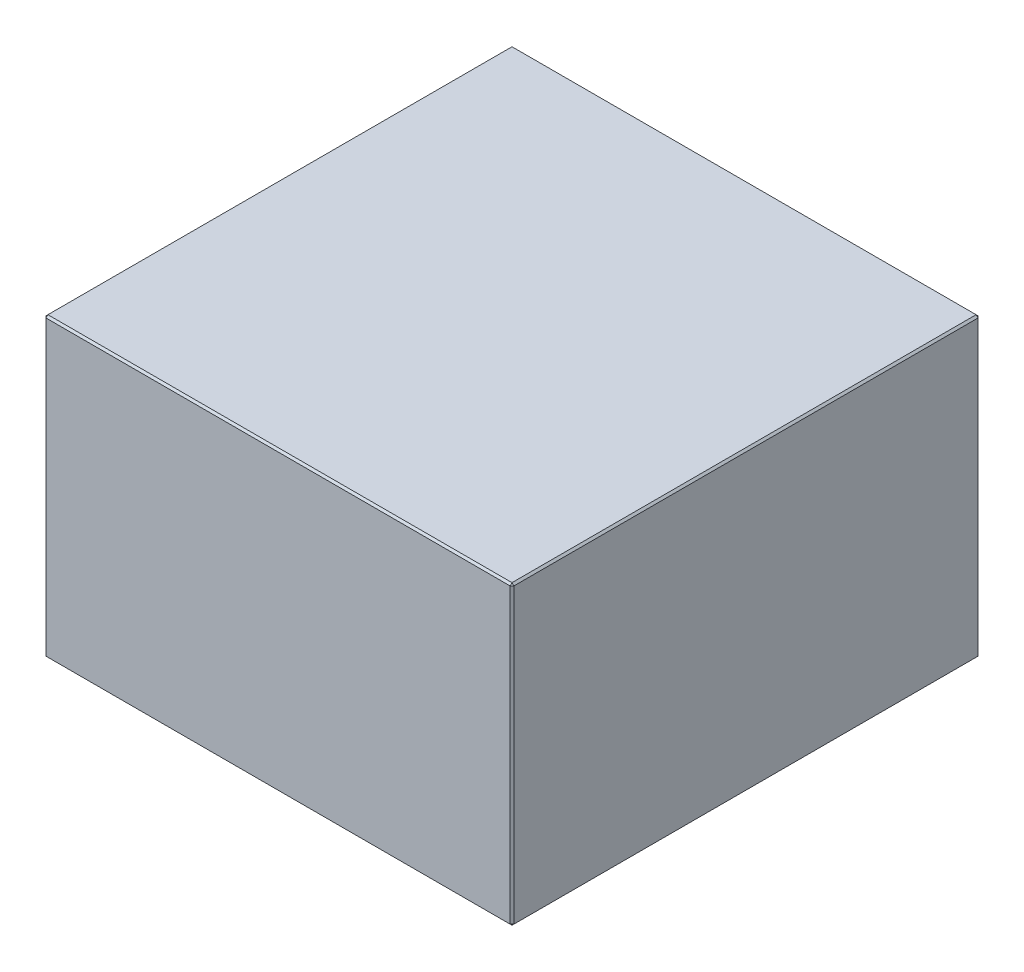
ISO-10303-21;
HEADER;
FILE_DESCRIPTION(('STEP AP214'),'2;1');
FILE_NAME('part.step','',(''),(''),'','','');
FILE_SCHEMA(('AUTOMOTIVE_DESIGN { 1 0 10303 214 1 1 1 1 }'));
ENDSEC;
DATA;
#1=APPLICATION_CONTEXT('core data for automotive mechanical design processes');
#2=APPLICATION_PROTOCOL_DEFINITION('international standard','automotive_design',2000,#1);
#3=PRODUCT_CONTEXT('',#1,'mechanical');
#4=PRODUCT('Part','Part','',(#3));
#5=PRODUCT_RELATED_PRODUCT_CATEGORY('part','',(#4));
#6=PRODUCT_DEFINITION_FORMATION('','',#4);
#7=PRODUCT_DEFINITION_CONTEXT('part definition',#1,'design');
#8=PRODUCT_DEFINITION('design','',#6,#7);
#9=PRODUCT_DEFINITION_SHAPE('','',#8);
#10=(LENGTH_UNIT() NAMED_UNIT(*) SI_UNIT(.MILLI.,.METRE.));
#11=(NAMED_UNIT(*) PLANE_ANGLE_UNIT() SI_UNIT($,.RADIAN.));
#12=(NAMED_UNIT(*) SI_UNIT($,.STERADIAN.) SOLID_ANGLE_UNIT());
#13=UNCERTAINTY_MEASURE_WITH_UNIT(LENGTH_MEASURE(1.E-05),#10,'distance_accuracy_value','');
#14=(GEOMETRIC_REPRESENTATION_CONTEXT(3) GLOBAL_UNCERTAINTY_ASSIGNED_CONTEXT((#13)) GLOBAL_UNIT_ASSIGNED_CONTEXT((#10,
#11,#12)) REPRESENTATION_CONTEXT('',''));
#15=CARTESIAN_POINT('',(0.,0.,0.));
#16=DIRECTION('',(0.,0.,1.));
#17=DIRECTION('',(1.,0.,0.));
#18=AXIS2_PLACEMENT_3D('',#15,#16,#17);
#19=CARTESIAN_POINT('',(-123.,156.,123.));
#20=DIRECTION('',(1.,0.,0.));
#21=DIRECTION('',(0.,0.,-1.));
#22=AXIS2_PLACEMENT_3D('',#19,#20,#21);
#23=PLANE('',#22);
#24=DIRECTION('',(0.,-1.,0.));
#25=VECTOR('',#24,1.);
#26=CARTESIAN_POINT('',(-123.,156.,-122.));
#27=LINE('',#26,#25);
#28=CARTESIAN_POINT('',(-123.,155.,-122.));
#29=VERTEX_POINT('',#28);
#30=CARTESIAN_POINT('',(-123.,0.999999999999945,-122.));
#31=VERTEX_POINT('',#30);
#32=EDGE_CURVE('E115',#29,#31,#27,.T.);
#33=ORIENTED_EDGE('',*,*,#32,.T.);
#34=DIRECTION('',(0.,0.,1.));
#35=VECTOR('',#34,1.);
#36=CARTESIAN_POINT('',(-123.,0.999999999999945,123.));
#37=LINE('',#36,#35);
#38=CARTESIAN_POINT('',(-123.,0.999999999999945,122.));
#39=VERTEX_POINT('',#38);
#40=EDGE_CURVE('E111',#31,#39,#37,.T.);
#41=ORIENTED_EDGE('',*,*,#40,.T.);
#42=DIRECTION('',(0.,1.,0.));
#43=VECTOR('',#42,1.);
#44=CARTESIAN_POINT('',(-123.,156.,122.));
#45=LINE('',#44,#43);
#46=CARTESIAN_POINT('',(-123.,155.,122.));
#47=VERTEX_POINT('',#46);
#48=EDGE_CURVE('E104',#39,#47,#45,.T.);
#49=ORIENTED_EDGE('',*,*,#48,.T.);
#50=DIRECTION('',(0.,0.,-1.));
#51=VECTOR('',#50,1.);
#52=CARTESIAN_POINT('',(-123.,155.,-123.));
#53=LINE('',#52,#51);
#54=EDGE_CURVE('E108',#47,#29,#53,.T.);
#55=ORIENTED_EDGE('',*,*,#54,.T.);
#56=EDGE_LOOP('',(#33,#41,#49,#55));
#57=FACE_BOUND('',#56,.T.);
#58=ADVANCED_FACE('F16',(#57),#23,.F.);
#59=CARTESIAN_POINT('',(123.,156.,123.));
#60=DIRECTION('',(0.,0.,-1.));
#61=DIRECTION('',(-1.,0.,0.));
#62=AXIS2_PLACEMENT_3D('',#59,#60,#61);
#63=PLANE('',#62);
#64=DIRECTION('',(-1.,0.,0.));
#65=VECTOR('',#64,1.);
#66=CARTESIAN_POINT('',(-123.,155.,123.));
#67=LINE('',#66,#65);
#68=CARTESIAN_POINT('',(122.,155.,123.));
#69=VERTEX_POINT('',#68);
#70=CARTESIAN_POINT('',(-122.,155.,123.));
#71=VERTEX_POINT('',#70);
#72=EDGE_CURVE('E165',#69,#71,#67,.T.);
#73=ORIENTED_EDGE('',*,*,#72,.T.);
#74=DIRECTION('',(0.,-1.,0.));
#75=VECTOR('',#74,1.);
#76=CARTESIAN_POINT('',(-122.,156.,123.));
#77=LINE('',#76,#75);
#78=CARTESIAN_POINT('',(-122.,1.,123.));
#79=VERTEX_POINT('',#78);
#80=EDGE_CURVE('E123',#71,#79,#77,.T.);
#81=ORIENTED_EDGE('',*,*,#80,.T.);
#82=DIRECTION('',(1.,0.,0.));
#83=VECTOR('',#82,1.);
#84=CARTESIAN_POINT('',(123.,1.,123.));
#85=LINE('',#84,#83);
#86=CARTESIAN_POINT('',(122.,1.,123.));
#87=VERTEX_POINT('',#86);
#88=EDGE_CURVE('E169',#79,#87,#85,.T.);
#89=ORIENTED_EDGE('',*,*,#88,.T.);
#90=DIRECTION('',(0.,1.,0.));
#91=VECTOR('',#90,1.);
#92=CARTESIAN_POINT('',(122.,156.,123.));
#93=LINE('',#92,#91);
#94=EDGE_CURVE('E167',#87,#69,#93,.T.);
#95=ORIENTED_EDGE('',*,*,#94,.T.);
#96=EDGE_LOOP('',(#73,#81,#89,#95));
#97=FACE_BOUND('',#96,.T.);
#98=ADVANCED_FACE('F276',(#97),#63,.F.);
#99=CARTESIAN_POINT('',(123.,156.,123.));
#100=DIRECTION('',(-1.,0.,0.));
#101=DIRECTION('',(0.,0.,1.));
#102=AXIS2_PLACEMENT_3D('',#99,#100,#101);
#103=PLANE('',#102);
#104=DIRECTION('',(0.,0.,-1.));
#105=VECTOR('',#104,1.);
#106=CARTESIAN_POINT('',(123.,1.,123.));
#107=LINE('',#106,#105);
#108=CARTESIAN_POINT('',(123.,1.,122.));
#109=VERTEX_POINT('',#108);
#110=CARTESIAN_POINT('',(123.,1.,-122.));
#111=VERTEX_POINT('',#110);
#112=EDGE_CURVE('E160',#109,#111,#107,.T.);
#113=ORIENTED_EDGE('',*,*,#112,.T.);
#114=DIRECTION('',(0.,1.,0.));
#115=VECTOR('',#114,1.);
#116=CARTESIAN_POINT('',(123.,156.,-122.));
#117=LINE('',#116,#115);
#118=CARTESIAN_POINT('',(123.,155.,-122.));
#119=VERTEX_POINT('',#118);
#120=EDGE_CURVE('E162',#111,#119,#117,.T.);
#121=ORIENTED_EDGE('',*,*,#120,.T.);
#122=DIRECTION('',(0.,0.,1.));
#123=VECTOR('',#122,1.);
#124=CARTESIAN_POINT('',(123.,155.,123.));
#125=LINE('',#124,#123);
#126=CARTESIAN_POINT('',(123.,155.,122.));
#127=VERTEX_POINT('',#126);
#128=EDGE_CURVE('E156',#119,#127,#125,.T.);
#129=ORIENTED_EDGE('',*,*,#128,.T.);
#130=DIRECTION('',(0.,-1.,0.));
#131=VECTOR('',#130,1.);
#132=CARTESIAN_POINT('',(123.,156.,122.));
#133=LINE('',#132,#131);
#134=EDGE_CURVE('E158',#127,#109,#133,.T.);
#135=ORIENTED_EDGE('',*,*,#134,.T.);
#136=EDGE_LOOP('',(#113,#121,#129,#135));
#137=FACE_BOUND('',#136,.T.);
#138=ADVANCED_FACE('F255',(#137),#103,.F.);
#139=CARTESIAN_POINT('',(123.,156.,-123.));
#140=DIRECTION('',(0.,0.,1.));
#141=DIRECTION('',(1.,0.,0.));
#142=AXIS2_PLACEMENT_3D('',#139,#140,#141);
#143=PLANE('',#142);
#144=DIRECTION('',(0.,-1.,0.));
#145=VECTOR('',#144,1.);
#146=CARTESIAN_POINT('',(122.,156.,-123.));
#147=LINE('',#146,#145);
#148=CARTESIAN_POINT('',(122.,155.,-123.));
#149=VERTEX_POINT('',#148);
#150=CARTESIAN_POINT('',(122.,1.,-123.));
#151=VERTEX_POINT('',#150);
#152=EDGE_CURVE('E149',#149,#151,#147,.T.);
#153=ORIENTED_EDGE('',*,*,#152,.T.);
#154=DIRECTION('',(-1.,0.,0.));
#155=VECTOR('',#154,1.);
#156=CARTESIAN_POINT('',(123.,1.,-123.));
#157=LINE('',#156,#155);
#158=CARTESIAN_POINT('',(-122.,1.,-123.));
#159=VERTEX_POINT('',#158);
#160=EDGE_CURVE('E154',#151,#159,#157,.T.);
#161=ORIENTED_EDGE('',*,*,#160,.T.);
#162=DIRECTION('',(0.,1.,0.));
#163=VECTOR('',#162,1.);
#164=CARTESIAN_POINT('',(-122.,156.,-123.));
#165=LINE('',#164,#163);
#166=CARTESIAN_POINT('',(-122.,155.,-123.));
#167=VERTEX_POINT('',#166);
#168=EDGE_CURVE('E151',#159,#167,#165,.T.);
#169=ORIENTED_EDGE('',*,*,#168,.T.);
#170=DIRECTION('',(1.,0.,0.));
#171=VECTOR('',#170,1.);
#172=CARTESIAN_POINT('',(123.,155.,-123.));
#173=LINE('',#172,#171);
#174=EDGE_CURVE('E147',#167,#149,#173,.T.);
#175=ORIENTED_EDGE('',*,*,#174,.T.);
#176=EDGE_LOOP('',(#153,#161,#169,#175));
#177=FACE_BOUND('',#176,.T.);
#178=ADVANCED_FACE('F285',(#177),#143,.F.);
#179=CARTESIAN_POINT('',(0.,156.,0.));
#180=DIRECTION('',(0.,1.,0.));
#181=DIRECTION('',(0.,0.,1.));
#182=AXIS2_PLACEMENT_3D('',#179,#180,#181);
#183=PLANE('',#182);
#184=DIRECTION('',(0.,0.,-1.));
#185=VECTOR('',#184,1.);
#186=CARTESIAN_POINT('',(122.,156.,-123.));
#187=LINE('',#186,#185);
#188=CARTESIAN_POINT('',(122.,156.,122.));
#189=VERTEX_POINT('',#188);
#190=CARTESIAN_POINT('',(122.,156.,-122.));
#191=VERTEX_POINT('',#190);
#192=EDGE_CURVE('E25',#189,#191,#187,.T.);
#193=ORIENTED_EDGE('',*,*,#192,.T.);
#194=DIRECTION('',(-1.,0.,0.));
#195=VECTOR('',#194,1.);
#196=CARTESIAN_POINT('',(-123.,156.,-122.));
#197=LINE('',#196,#195);
#198=CARTESIAN_POINT('',(-122.,156.,-122.));
#199=VERTEX_POINT('',#198);
#200=EDGE_CURVE('E10',#191,#199,#197,.T.);
#201=ORIENTED_EDGE('',*,*,#200,.T.);
#202=DIRECTION('',(0.,0.,1.));
#203=VECTOR('',#202,1.);
#204=CARTESIAN_POINT('',(-122.,156.,123.));
#205=LINE('',#204,#203);
#206=CARTESIAN_POINT('',(-122.,156.,122.));
#207=VERTEX_POINT('',#206);
#208=EDGE_CURVE('E181',#199,#207,#205,.T.);
#209=ORIENTED_EDGE('',*,*,#208,.T.);
#210=DIRECTION('',(1.,0.,0.));
#211=VECTOR('',#210,1.);
#212=CARTESIAN_POINT('',(123.,156.,122.));
#213=LINE('',#212,#211);
#214=EDGE_CURVE('E36',#207,#189,#213,.T.);
#215=ORIENTED_EDGE('',*,*,#214,.T.);
#216=EDGE_LOOP('',(#193,#201,#209,#215));
#217=FACE_BOUND('',#216,.T.);
#218=ADVANCED_FACE('F351',(#217),#183,.T.);
#219=CARTESIAN_POINT('',(0.,0.,0.));
#220=DIRECTION('',(0.,1.,0.));
#221=DIRECTION('',(0.,0.,1.));
#222=AXIS2_PLACEMENT_3D('',#219,#220,#221);
#223=PLANE('',#222);
#224=DIRECTION('',(0.,0.,1.));
#225=VECTOR('',#224,1.);
#226=CARTESIAN_POINT('',(122.,0.,0.));
#227=LINE('',#226,#225);
#228=CARTESIAN_POINT('',(122.,0.,-122.));
#229=VERTEX_POINT('',#228);
#230=CARTESIAN_POINT('',(122.,0.,122.));
#231=VERTEX_POINT('',#230);
#232=EDGE_CURVE('E172',#229,#231,#227,.T.);
#233=ORIENTED_EDGE('',*,*,#232,.T.);
#234=DIRECTION('',(-1.,0.,0.));
#235=VECTOR('',#234,1.);
#236=CARTESIAN_POINT('',(0.,0.,122.));
#237=LINE('',#236,#235);
#238=CARTESIAN_POINT('',(-122.,0.,122.));
#239=VERTEX_POINT('',#238);
#240=EDGE_CURVE('E178',#231,#239,#237,.T.);
#241=ORIENTED_EDGE('',*,*,#240,.T.);
#242=DIRECTION('',(0.,0.,-1.));
#243=VECTOR('',#242,1.);
#244=CARTESIAN_POINT('',(-122.,0.,0.));
#245=LINE('',#244,#243);
#246=CARTESIAN_POINT('',(-122.,0.,-122.));
#247=VERTEX_POINT('',#246);
#248=EDGE_CURVE('E176',#239,#247,#245,.T.);
#249=ORIENTED_EDGE('',*,*,#248,.T.);
#250=DIRECTION('',(1.,0.,0.));
#251=VECTOR('',#250,1.);
#252=CARTESIAN_POINT('',(0.,0.,-122.));
#253=LINE('',#252,#251);
#254=EDGE_CURVE('E174',#247,#229,#253,.T.);
#255=ORIENTED_EDGE('',*,*,#254,.T.);
#256=EDGE_LOOP('',(#233,#241,#249,#255));
#257=FACE_BOUND('',#256,.T.);
#258=ADVANCED_FACE('F247',(#257),#223,.F.);
#259=CARTESIAN_POINT('',(123.,156.,122.));
#260=DIRECTION('',(-0.707106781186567,0.,-0.707106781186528));
#261=DIRECTION('',(0.,-1.,0.));
#262=AXIS2_PLACEMENT_3D('',#259,#260,#261);
#263=PLANE('',#262);
#264=DIRECTION('',(-0.707106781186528,0.,0.707106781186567));
#265=VECTOR('',#264,1.);
#266=CARTESIAN_POINT('',(122.,155.,123.));
#267=LINE('',#266,#265);
#268=EDGE_CURVE('E20',#69,#127,#267,.F.);
#269=ORIENTED_EDGE('',*,*,#268,.F.);
#270=ORIENTED_EDGE('',*,*,#94,.F.);
#271=DIRECTION('',(0.707106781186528,0.,-0.707106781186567));
#272=VECTOR('',#271,1.);
#273=CARTESIAN_POINT('',(122.,1.,123.));
#274=LINE('',#273,#272);
#275=EDGE_CURVE('E143',#109,#87,#274,.F.);
#276=ORIENTED_EDGE('',*,*,#275,.F.);
#277=ORIENTED_EDGE('',*,*,#134,.F.);
#278=EDGE_LOOP('',(#269,#270,#276,#277));
#279=FACE_BOUND('',#278,.T.);
#280=ADVANCED_FACE('F18',(#279),#263,.F.);
#281=CARTESIAN_POINT('',(122.,155.,123.));
#282=DIRECTION('',(0.577350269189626,0.577350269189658,0.577350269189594));
#283=DIRECTION('',(-0.707106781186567,0.707106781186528,0.));
#284=AXIS2_PLACEMENT_3D('',#281,#282,#283);
#285=PLANE('',#284);
#286=DIRECTION('',(0.,-0.70710678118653,0.707106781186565));
#287=VECTOR('',#286,1.);
#288=CARTESIAN_POINT('',(122.,155.,123.));
#289=LINE('',#288,#287);
#290=EDGE_CURVE('E227',#69,#189,#289,.F.);
#291=ORIENTED_EDGE('',*,*,#290,.F.);
#292=ORIENTED_EDGE('',*,*,#268,.T.);
#293=DIRECTION('',(-0.707106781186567,0.707106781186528,0.));
#294=VECTOR('',#293,1.);
#295=CARTESIAN_POINT('',(122.5,155.5,122.));
#296=LINE('',#295,#294);
#297=EDGE_CURVE('E229',#189,#127,#296,.F.);
#298=ORIENTED_EDGE('',*,*,#297,.F.);
#299=EDGE_LOOP('',(#291,#292,#298));
#300=FACE_BOUND('',#299,.T.);
#301=ADVANCED_FACE('F271',(#300),#285,.T.);
#302=CARTESIAN_POINT('',(122.,1.,123.));
#303=DIRECTION('',(0.577350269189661,-0.577350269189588,0.577350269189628));
#304=DIRECTION('',(0.707106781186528,0.,-0.707106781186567));
#305=AXIS2_PLACEMENT_3D('',#302,#303,#304);
#306=PLANE('',#305);
#307=DIRECTION('',(-0.707106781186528,-0.707106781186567,0.));
#308=VECTOR('',#307,1.);
#309=CARTESIAN_POINT('',(122.5,0.499999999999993,122.));
#310=LINE('',#309,#308);
#311=EDGE_CURVE('E221',#109,#231,#310,.T.);
#312=ORIENTED_EDGE('',*,*,#311,.F.);
#313=ORIENTED_EDGE('',*,*,#275,.T.);
#314=DIRECTION('',(0.,0.70710678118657,0.707106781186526));
#315=VECTOR('',#314,1.);
#316=CARTESIAN_POINT('',(122.,1.,123.));
#317=LINE('',#316,#315);
#318=EDGE_CURVE('E224',#231,#87,#317,.T.);
#319=ORIENTED_EDGE('',*,*,#318,.F.);
#320=EDGE_LOOP('',(#312,#313,#319));
#321=FACE_BOUND('',#320,.T.);
#322=ADVANCED_FACE('F236',(#321),#306,.T.);
#323=CARTESIAN_POINT('',(122.,156.,0.));
#324=DIRECTION('',(0.707106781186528,0.707106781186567,0.));
#325=DIRECTION('',(0.,0.,1.));
#326=AXIS2_PLACEMENT_3D('',#323,#324,#325);
#327=PLANE('',#326);
#328=ORIENTED_EDGE('',*,*,#297,.T.);
#329=ORIENTED_EDGE('',*,*,#128,.F.);
#330=DIRECTION('',(0.707106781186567,-0.707106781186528,0.));
#331=VECTOR('',#330,1.);
#332=CARTESIAN_POINT('',(123.,155.,-122.));
#333=LINE('',#332,#331);
#334=EDGE_CURVE('E216',#191,#119,#333,.T.);
#335=ORIENTED_EDGE('',*,*,#334,.F.);
#336=ORIENTED_EDGE('',*,*,#192,.F.);
#337=EDGE_LOOP('',(#328,#329,#335,#336));
#338=FACE_BOUND('',#337,.T.);
#339=ADVANCED_FACE('F266',(#338),#327,.T.);
#340=CARTESIAN_POINT('',(0.,156.,122.));
#341=DIRECTION('',(0.,0.707106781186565,0.70710678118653));
#342=DIRECTION('',(-1.,0.,0.));
#343=AXIS2_PLACEMENT_3D('',#340,#341,#342);
#344=PLANE('',#343);
#345=ORIENTED_EDGE('',*,*,#290,.T.);
#346=ORIENTED_EDGE('',*,*,#214,.F.);
#347=DIRECTION('',(0.,0.70710678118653,-0.707106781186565));
#348=VECTOR('',#347,1.);
#349=CARTESIAN_POINT('',(-122.,155.5,122.5));
#350=LINE('',#349,#348);
#351=EDGE_CURVE('E127',#71,#207,#350,.T.);
#352=ORIENTED_EDGE('',*,*,#351,.F.);
#353=ORIENTED_EDGE('',*,*,#72,.F.);
#354=EDGE_LOOP('',(#345,#346,#352,#353));
#355=FACE_BOUND('',#354,.T.);
#356=ADVANCED_FACE('F274',(#355),#344,.T.);
#357=CARTESIAN_POINT('',(-122.,156.,123.));
#358=DIRECTION('',(0.707106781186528,0.,-0.707106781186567));
#359=DIRECTION('',(0.,-1.,0.));
#360=AXIS2_PLACEMENT_3D('',#357,#358,#359);
#361=PLANE('',#360);
#362=DIRECTION('',(0.707106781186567,0.,0.707106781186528));
#363=VECTOR('',#362,1.);
#364=CARTESIAN_POINT('',(-122.,1.,123.));
#365=LINE('',#364,#363);
#366=EDGE_CURVE('E128',#79,#39,#365,.F.);
#367=ORIENTED_EDGE('',*,*,#366,.F.);
#368=ORIENTED_EDGE('',*,*,#80,.F.);
#369=DIRECTION('',(-0.707106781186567,0.,-0.707106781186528));
#370=VECTOR('',#369,1.);
#371=CARTESIAN_POINT('',(-123.,155.,122.));
#372=LINE('',#371,#370);
#373=EDGE_CURVE('E119',#47,#71,#372,.F.);
#374=ORIENTED_EDGE('',*,*,#373,.F.);
#375=ORIENTED_EDGE('',*,*,#48,.F.);
#376=EDGE_LOOP('',(#367,#368,#374,#375));
#377=FACE_BOUND('',#376,.T.);
#378=ADVANCED_FACE('F121',(#377),#361,.F.);
#379=CARTESIAN_POINT('',(123.,1.,123.));
#380=DIRECTION('',(0.,0.707106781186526,-0.70710678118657));
#381=DIRECTION('',(1.,0.,0.));
#382=AXIS2_PLACEMENT_3D('',#379,#380,#381);
#383=PLANE('',#382);
#384=ORIENTED_EDGE('',*,*,#318,.T.);
#385=ORIENTED_EDGE('',*,*,#88,.F.);
#386=DIRECTION('',(0.,-0.70710678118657,-0.707106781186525));
#387=VECTOR('',#386,1.);
#388=CARTESIAN_POINT('',(-122.,1.,123.));
#389=LINE('',#388,#387);
#390=EDGE_CURVE('E212',#239,#79,#389,.F.);
#391=ORIENTED_EDGE('',*,*,#390,.F.);
#392=ORIENTED_EDGE('',*,*,#240,.F.);
#393=EDGE_LOOP('',(#384,#385,#391,#392));
#394=FACE_BOUND('',#393,.T.);
#395=ADVANCED_FACE('F244',(#394),#383,.F.);
#396=CARTESIAN_POINT('',(123.,1.,123.));
#397=DIRECTION('',(-0.707106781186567,0.707106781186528,0.));
#398=DIRECTION('',(0.,0.,-1.));
#399=AXIS2_PLACEMENT_3D('',#396,#397,#398);
#400=PLANE('',#399);
#401=ORIENTED_EDGE('',*,*,#311,.T.);
#402=ORIENTED_EDGE('',*,*,#232,.F.);
#403=DIRECTION('',(0.707106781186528,0.707106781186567,0.));
#404=VECTOR('',#403,1.);
#405=CARTESIAN_POINT('',(122.5,0.499999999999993,-122.));
#406=LINE('',#405,#404);
#407=EDGE_CURVE('E209',#111,#229,#406,.F.);
#408=ORIENTED_EDGE('',*,*,#407,.F.);
#409=ORIENTED_EDGE('',*,*,#112,.F.);
#410=EDGE_LOOP('',(#401,#402,#408,#409));
#411=FACE_BOUND('',#410,.T.);
#412=ADVANCED_FACE('F252',(#411),#400,.F.);
#413=CARTESIAN_POINT('',(122.,156.,-123.));
#414=DIRECTION('',(-0.707106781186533,0.,0.707106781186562));
#415=DIRECTION('',(0.,-1.,0.));
#416=AXIS2_PLACEMENT_3D('',#413,#414,#415);
#417=PLANE('',#416);
#418=DIRECTION('',(0.707106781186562,0.,0.707106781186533));
#419=VECTOR('',#418,1.);
#420=CARTESIAN_POINT('',(123.,155.,-122.));
#421=LINE('',#420,#419);
#422=EDGE_CURVE('E218',#119,#149,#421,.F.);
#423=ORIENTED_EDGE('',*,*,#422,.F.);
#424=ORIENTED_EDGE('',*,*,#120,.F.);
#425=DIRECTION('',(-0.707106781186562,0.,-0.707106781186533));
#426=VECTOR('',#425,1.);
#427=CARTESIAN_POINT('',(122.,1.,-123.));
#428=LINE('',#427,#426);
#429=EDGE_CURVE('E206',#151,#111,#428,.F.);
#430=ORIENTED_EDGE('',*,*,#429,.F.);
#431=ORIENTED_EDGE('',*,*,#152,.F.);
#432=EDGE_LOOP('',(#423,#424,#430,#431));
#433=FACE_BOUND('',#432,.T.);
#434=ADVANCED_FACE('F259',(#433),#417,.F.);
#435=CARTESIAN_POINT('',(123.,155.,-122.));
#436=DIRECTION('',(0.577350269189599,0.577350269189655,-0.577350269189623));
#437=DIRECTION('',(0.,0.707106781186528,0.707106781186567));
#438=AXIS2_PLACEMENT_3D('',#435,#436,#437);
#439=PLANE('',#438);
#440=ORIENTED_EDGE('',*,*,#334,.T.);
#441=ORIENTED_EDGE('',*,*,#422,.T.);
#442=DIRECTION('',(0.,0.70710678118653,0.707106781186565));
#443=VECTOR('',#442,1.);
#444=CARTESIAN_POINT('',(122.,155.5,-122.5));
#445=LINE('',#444,#443);
#446=EDGE_CURVE('E135',#191,#149,#445,.F.);
#447=ORIENTED_EDGE('',*,*,#446,.F.);
#448=EDGE_LOOP('',(#440,#441,#447));
#449=FACE_BOUND('',#448,.T.);
#450=ADVANCED_FACE('F326',(#449),#439,.T.);
#451=CARTESIAN_POINT('',(-123.,155.,122.));
#452=DIRECTION('',(-0.577350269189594,0.577350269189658,0.577350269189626));
#453=DIRECTION('',(0.,-0.707106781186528,0.707106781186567));
#454=AXIS2_PLACEMENT_3D('',#451,#452,#453);
#455=PLANE('',#454);
#456=ORIENTED_EDGE('',*,*,#373,.T.);
#457=ORIENTED_EDGE('',*,*,#351,.T.);
#458=DIRECTION('',(-0.707106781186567,-0.707106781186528,0.));
#459=VECTOR('',#458,1.);
#460=CARTESIAN_POINT('',(-123.,155.,122.));
#461=LINE('',#460,#459);
#462=EDGE_CURVE('E131',#47,#207,#461,.F.);
#463=ORIENTED_EDGE('',*,*,#462,.F.);
#464=EDGE_LOOP('',(#456,#457,#463));
#465=FACE_BOUND('',#464,.T.);
#466=ADVANCED_FACE('F132',(#465),#455,.T.);
#467=CARTESIAN_POINT('',(-122.,1.,123.));
#468=DIRECTION('',(-0.577350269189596,-0.57735026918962,0.577350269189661));
#469=DIRECTION('',(0.,-0.707106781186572,-0.707106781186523));
#470=AXIS2_PLACEMENT_3D('',#467,#468,#469);
#471=PLANE('',#470);
#472=ORIENTED_EDGE('',*,*,#390,.T.);
#473=ORIENTED_EDGE('',*,*,#366,.T.);
#474=DIRECTION('',(-0.707106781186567,0.707106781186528,0.));
#475=VECTOR('',#474,1.);
#476=CARTESIAN_POINT('',(-122.5,0.499999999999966,122.));
#477=LINE('',#476,#475);
#478=EDGE_CURVE('E136',#239,#39,#477,.T.);
#479=ORIENTED_EDGE('',*,*,#478,.F.);
#480=EDGE_LOOP('',(#472,#473,#479));
#481=FACE_BOUND('',#480,.T.);
#482=ADVANCED_FACE('F319',(#481),#471,.T.);
#483=CARTESIAN_POINT('',(122.,1.,-123.));
#484=DIRECTION('',(0.577350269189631,-0.577350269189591,-0.577350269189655));
#485=DIRECTION('',(-0.707106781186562,0.,-0.707106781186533));
#486=AXIS2_PLACEMENT_3D('',#483,#484,#485);
#487=PLANE('',#486);
#488=ORIENTED_EDGE('',*,*,#429,.T.);
#489=ORIENTED_EDGE('',*,*,#407,.T.);
#490=DIRECTION('',(0.,-0.70710678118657,0.707106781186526));
#491=VECTOR('',#490,1.);
#492=CARTESIAN_POINT('',(122.,1.,-123.));
#493=LINE('',#492,#491);
#494=EDGE_CURVE('E199',#151,#229,#493,.T.);
#495=ORIENTED_EDGE('',*,*,#494,.F.);
#496=EDGE_LOOP('',(#488,#489,#495));
#497=FACE_BOUND('',#496,.T.);
#498=ADVANCED_FACE('F315',(#497),#487,.T.);
#499=CARTESIAN_POINT('',(0.,156.,-122.));
#500=DIRECTION('',(0.,0.707106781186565,-0.70710678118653));
#501=DIRECTION('',(1.,0.,0.));
#502=AXIS2_PLACEMENT_3D('',#499,#500,#501);
#503=PLANE('',#502);
#504=ORIENTED_EDGE('',*,*,#446,.T.);
#505=ORIENTED_EDGE('',*,*,#174,.F.);
#506=DIRECTION('',(0.,-0.70710678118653,-0.707106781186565));
#507=VECTOR('',#506,1.);
#508=CARTESIAN_POINT('',(-122.,155.,-123.));
#509=LINE('',#508,#507);
#510=EDGE_CURVE('E196',#199,#167,#509,.T.);
#511=ORIENTED_EDGE('',*,*,#510,.F.);
#512=ORIENTED_EDGE('',*,*,#200,.F.);
#513=EDGE_LOOP('',(#504,#505,#511,#512));
#514=FACE_BOUND('',#513,.T.);
#515=ADVANCED_FACE('F312',(#514),#503,.T.);
#516=CARTESIAN_POINT('',(-122.,156.,0.));
#517=DIRECTION('',(-0.707106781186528,0.707106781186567,0.));
#518=DIRECTION('',(0.,0.,-1.));
#519=AXIS2_PLACEMENT_3D('',#516,#517,#518);
#520=PLANE('',#519);
#521=ORIENTED_EDGE('',*,*,#462,.T.);
#522=ORIENTED_EDGE('',*,*,#208,.F.);
#523=DIRECTION('',(0.707106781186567,0.707106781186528,0.));
#524=VECTOR('',#523,1.);
#525=CARTESIAN_POINT('',(-122.5,155.5,-122.));
#526=LINE('',#525,#524);
#527=EDGE_CURVE('E139',#29,#199,#526,.T.);
#528=ORIENTED_EDGE('',*,*,#527,.F.);
#529=ORIENTED_EDGE('',*,*,#54,.F.);
#530=EDGE_LOOP('',(#521,#522,#528,#529));
#531=FACE_BOUND('',#530,.T.);
#532=ADVANCED_FACE('F138',(#531),#520,.T.);
#533=CARTESIAN_POINT('',(-123.,0.999999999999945,123.));
#534=DIRECTION('',(0.707106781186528,0.707106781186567,0.));
#535=DIRECTION('',(0.,0.,1.));
#536=AXIS2_PLACEMENT_3D('',#533,#534,#535);
#537=PLANE('',#536);
#538=ORIENTED_EDGE('',*,*,#478,.T.);
#539=ORIENTED_EDGE('',*,*,#40,.F.);
#540=DIRECTION('',(0.707106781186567,-0.707106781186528,0.));
#541=VECTOR('',#540,1.);
#542=CARTESIAN_POINT('',(-123.,0.999999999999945,-122.));
#543=LINE('',#542,#541);
#544=EDGE_CURVE('E192',#247,#31,#543,.F.);
#545=ORIENTED_EDGE('',*,*,#544,.F.);
#546=ORIENTED_EDGE('',*,*,#248,.F.);
#547=EDGE_LOOP('',(#538,#539,#545,#546));
#548=FACE_BOUND('',#547,.T.);
#549=ADVANCED_FACE('F305',(#548),#537,.F.);
#550=CARTESIAN_POINT('',(123.,1.,-123.));
#551=DIRECTION('',(0.,0.707106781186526,0.70710678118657));
#552=DIRECTION('',(-1.,0.,0.));
#553=AXIS2_PLACEMENT_3D('',#550,#551,#552);
#554=PLANE('',#553);
#555=ORIENTED_EDGE('',*,*,#494,.T.);
#556=ORIENTED_EDGE('',*,*,#254,.F.);
#557=DIRECTION('',(0.,0.70710678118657,-0.707106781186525));
#558=VECTOR('',#557,1.);
#559=CARTESIAN_POINT('',(-122.,0.5,-122.5));
#560=LINE('',#559,#558);
#561=EDGE_CURVE('E189',#159,#247,#560,.F.);
#562=ORIENTED_EDGE('',*,*,#561,.F.);
#563=ORIENTED_EDGE('',*,*,#160,.F.);
#564=EDGE_LOOP('',(#555,#556,#562,#563));
#565=FACE_BOUND('',#564,.T.);
#566=ADVANCED_FACE('F301',(#565),#554,.F.);
#567=CARTESIAN_POINT('',(-122.,155.,-123.));
#568=DIRECTION('',(-0.577350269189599,0.577350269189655,-0.577350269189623));
#569=DIRECTION('',(0.,0.707106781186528,0.707106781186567));
#570=AXIS2_PLACEMENT_3D('',#567,#568,#569);
#571=PLANE('',#570);
#572=ORIENTED_EDGE('',*,*,#527,.T.);
#573=ORIENTED_EDGE('',*,*,#510,.T.);
#574=DIRECTION('',(0.707106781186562,0.,-0.707106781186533));
#575=VECTOR('',#574,1.);
#576=CARTESIAN_POINT('',(-122.,155.,-123.));
#577=LINE('',#576,#575);
#578=EDGE_CURVE('E187',#29,#167,#577,.T.);
#579=ORIENTED_EDGE('',*,*,#578,.F.);
#580=EDGE_LOOP('',(#572,#573,#579));
#581=FACE_BOUND('',#580,.T.);
#582=ADVANCED_FACE('F297',(#581),#571,.T.);
#583=CARTESIAN_POINT('',(-123.,0.999999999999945,-122.));
#584=DIRECTION('',(-0.577350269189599,-0.577350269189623,-0.577350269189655));
#585=DIRECTION('',(0.,0.707106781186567,-0.707106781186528));
#586=AXIS2_PLACEMENT_3D('',#583,#584,#585);
#587=PLANE('',#586);
#588=ORIENTED_EDGE('',*,*,#561,.T.);
#589=ORIENTED_EDGE('',*,*,#544,.T.);
#590=DIRECTION('',(-0.707106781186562,0.,0.707106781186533));
#591=VECTOR('',#590,1.);
#592=CARTESIAN_POINT('',(-123.,0.999999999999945,-122.));
#593=LINE('',#592,#591);
#594=EDGE_CURVE('E185',#159,#31,#593,.T.);
#595=ORIENTED_EDGE('',*,*,#594,.F.);
#596=EDGE_LOOP('',(#588,#589,#595));
#597=FACE_BOUND('',#596,.T.);
#598=ADVANCED_FACE('F293',(#597),#587,.T.);
#599=CARTESIAN_POINT('',(-123.,156.,-122.));
#600=DIRECTION('',(0.707106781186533,0.,0.707106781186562));
#601=DIRECTION('',(0.,-1.,0.));
#602=AXIS2_PLACEMENT_3D('',#599,#600,#601);
#603=PLANE('',#602);
#604=ORIENTED_EDGE('',*,*,#578,.T.);
#605=ORIENTED_EDGE('',*,*,#168,.F.);
#606=ORIENTED_EDGE('',*,*,#594,.T.);
#607=ORIENTED_EDGE('',*,*,#32,.F.);
#608=EDGE_LOOP('',(#604,#605,#606,#607));
#609=FACE_BOUND('',#608,.T.);
#610=ADVANCED_FACE('F290',(#609),#603,.F.);
#611=CLOSED_SHELL('',(#58,#98,#138,#178,#218,#258,#280,#301,#322,#339,#356,#378,#395,#412,#434,
#450,#466,#482,#498,#515,#532,#549,#566,#582,#598,#610));
#612=MANIFOLD_SOLID_BREP('B1',#611);
#613=ADVANCED_BREP_SHAPE_REPRESENTATION('',(#18,#612),#14);
#614=SHAPE_DEFINITION_REPRESENTATION(#9,#613);
ENDSEC;
END-ISO-10303-21;
